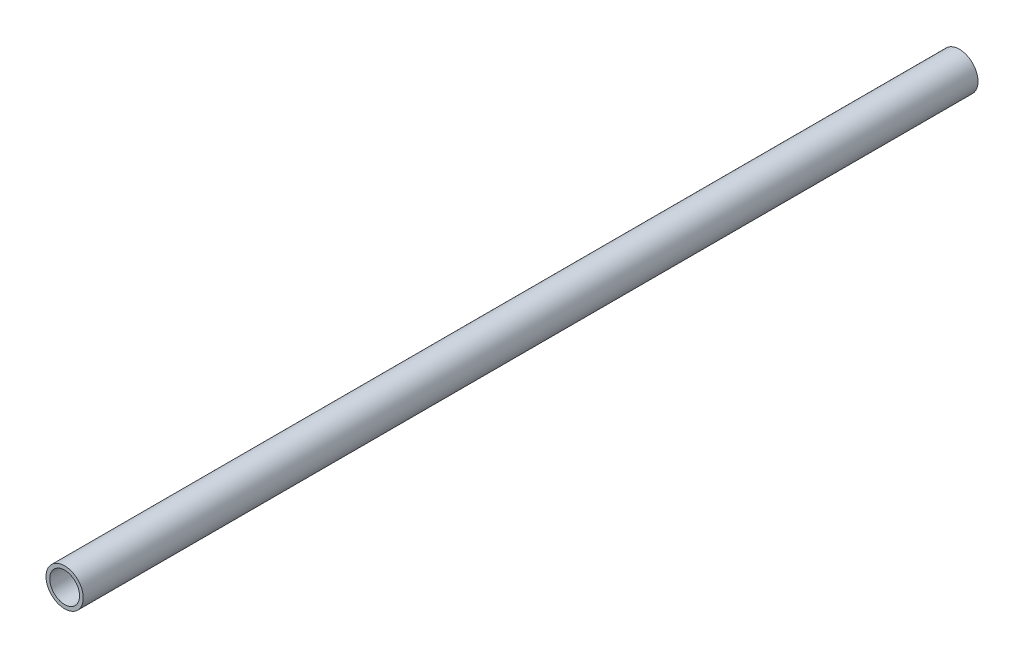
from build123d import *

# Parameters (mm, degrees)
SKETCH1_R           = 6.35
SKETCH1_R_2         = 5.08
BOSS_EXTRUDE1_DEPTH = 152.4


with BuildPart() as part:
    # Sketch1 → Boss-Extrude1 (new, symmetric)
    with BuildSketch(Plane.XY):
        with Locations(Location((0, 0, 0), (0, 0, 180))):
            Circle(SKETCH1_R)
        with Locations(Location((0, 0, 0), (0, 0, 180))):
            Circle(SKETCH1_R_2, mode=Mode.SUBTRACT)
    extrude(amount=BOSS_EXTRUDE1_DEPTH, both=True)


solid = part.part
